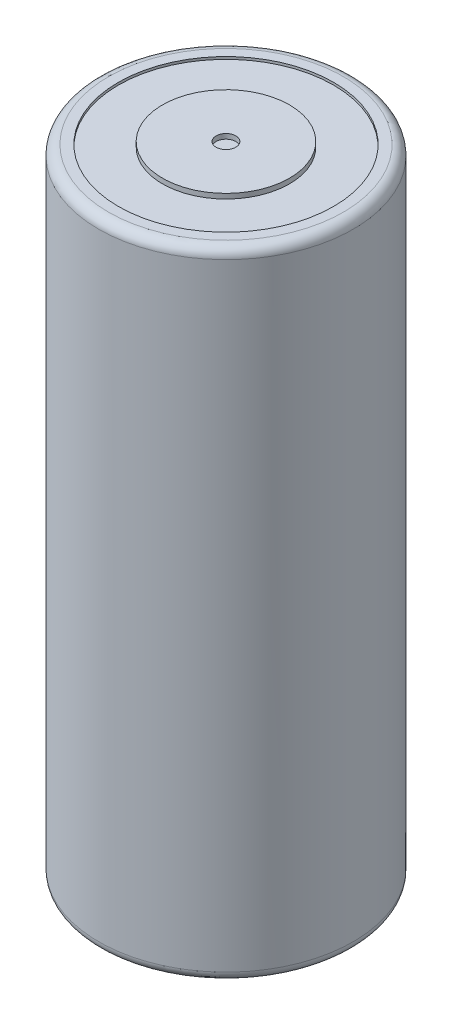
from build123d import *

# Parameters (mm, degrees)
FILLET5_R = 1


with BuildPart() as part:
    # Sketch2 → Revolve1 (revolve)
    with BuildSketch(Plane.XY, mode=Mode.PRIVATE) as revolve1_sk:
        Polygon((12.925, -0.25), (12.925, -64.9), (10.925, -64.9), (10.925, -64.65), (7.5, -64.65), (7.5, -65.15), (0, -65.15), (0, -0.5), (1, -0.5), (1, 0), (6.45, 0), (6.45, -0.5), (10.925, -0.5), (10.925, -0.25), align=None)
    revolve(revolve1_sk.sketch.rotate(Axis((0, -65.15, 0), (0, 1, 0)), 90), axis=Axis((0, -65.15, 0), (0, 1, 0)))

    # Fillet5
    fillet5_edges = [part.edges().sort_by_distance(p)[0] for p in [
        (0, -64.9, 12.925),
        (0, -0.25, 12.925),
    ]]
    fillet(fillet5_edges, radius=FILLET5_R)


solid = part.part
